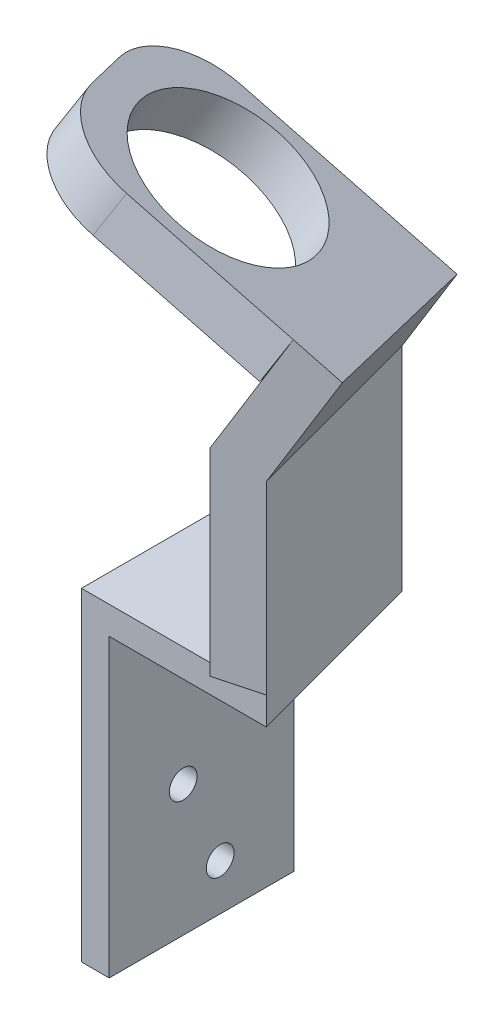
ISO-10303-21;
HEADER;
FILE_DESCRIPTION(('STEP AP214'),'2;1');
FILE_NAME('part.step','',(''),(''),'','','');
FILE_SCHEMA(('AUTOMOTIVE_DESIGN { 1 0 10303 214 1 1 1 1 }'));
ENDSEC;
DATA;
#1=APPLICATION_CONTEXT('core data for automotive mechanical design processes');
#2=APPLICATION_PROTOCOL_DEFINITION('international standard','automotive_design',2000,#1);
#3=PRODUCT_CONTEXT('',#1,'mechanical');
#4=PRODUCT('Part','Part','',(#3));
#5=PRODUCT_RELATED_PRODUCT_CATEGORY('part','',(#4));
#6=PRODUCT_DEFINITION_FORMATION('','',#4);
#7=PRODUCT_DEFINITION_CONTEXT('part definition',#1,'design');
#8=PRODUCT_DEFINITION('design','',#6,#7);
#9=PRODUCT_DEFINITION_SHAPE('','',#8);
#10=(LENGTH_UNIT() NAMED_UNIT(*) SI_UNIT(.MILLI.,.METRE.));
#11=(NAMED_UNIT(*) PLANE_ANGLE_UNIT() SI_UNIT($,.RADIAN.));
#12=(NAMED_UNIT(*) SI_UNIT($,.STERADIAN.) SOLID_ANGLE_UNIT());
#13=UNCERTAINTY_MEASURE_WITH_UNIT(LENGTH_MEASURE(1.E-05),#10,'distance_accuracy_value','');
#14=(GEOMETRIC_REPRESENTATION_CONTEXT(3) GLOBAL_UNCERTAINTY_ASSIGNED_CONTEXT((#13)) GLOBAL_UNIT_ASSIGNED_CONTEXT((#10,
#11,#12)) REPRESENTATION_CONTEXT('',''));
#15=CARTESIAN_POINT('',(0.,0.,0.));
#16=DIRECTION('',(0.,0.,1.));
#17=DIRECTION('',(1.,0.,0.));
#18=AXIS2_PLACEMENT_3D('',#15,#16,#17);
#19=CARTESIAN_POINT('',(14.8133485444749,79.150635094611,-30.9228119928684));
#20=DIRECTION('',(-0.836516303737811,0.499999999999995,0.224143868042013));
#21=DIRECTION('',(-0.5130541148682,-0.858356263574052,0.));
#22=AXIS2_PLACEMENT_3D('',#19,#20,#21);
#23=PLANE('',#22);
#24=DIRECTION('',(0.338752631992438,0.150383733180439,0.928779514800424));
#25=VECTOR('',#24,1.);
#26=CARTESIAN_POINT('',(13.0214505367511,61.6929223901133,1.3328304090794));
#27=LINE('',#26,#25);
#28=CARTESIAN_POINT('',(13.0214505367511,61.6929223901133,1.33283040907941));
#29=VERTEX_POINT('',#28);
#30=CARTESIAN_POINT('',(19.8450480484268,64.7221477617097,20.0415192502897));
#31=VERTEX_POINT('',#30);
#32=EDGE_CURVE('E199',#29,#31,#27,.T.);
#33=ORIENTED_EDGE('',*,*,#32,.F.);
#34=DIRECTION('',(-0.430682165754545,-0.852868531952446,0.295174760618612));
#35=VECTOR('',#34,1.);
#36=CARTESIAN_POINT('',(15.1748613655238,65.9572650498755,-0.143043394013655));
#37=LINE('',#36,#35);
#38=CARTESIAN_POINT('',(15.1748613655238,65.9572650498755,-0.143043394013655));
#39=VERTEX_POINT('',#38);
#40=EDGE_CURVE('E187',#39,#29,#37,.T.);
#41=ORIENTED_EDGE('',*,*,#40,.F.);
#42=DIRECTION('',(0.48296291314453,0.866025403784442,-0.129409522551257));
#43=VECTOR('',#42,1.);
#44=CARTESIAN_POINT('',(22.5325074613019,79.150635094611,-2.11451872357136));
#45=LINE('',#44,#43);
#46=CARTESIAN_POINT('',(9.81138701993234,56.3397459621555,1.29409522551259));
#47=VERTEX_POINT('',#46);
#48=EDGE_CURVE('E206',#47,#39,#45,.T.);
#49=ORIENTED_EDGE('',*,*,#48,.F.);
#50=DIRECTION('',(0.258819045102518,0.,0.965925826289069));
#51=VECTOR('',#50,1.);
#52=CARTESIAN_POINT('',(2.09222810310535,56.3397459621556,-27.5141980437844));
#53=LINE('',#52,#51);
#54=CARTESIAN_POINT('',(15.1703708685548,56.3397459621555,21.2940952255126));
#55=VERTEX_POINT('',#54);
#56=EDGE_CURVE('E181',#47,#55,#53,.T.);
#57=ORIENTED_EDGE('',*,*,#56,.T.);
#58=DIRECTION('',(-0.482962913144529,-0.866025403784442,0.129409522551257));
#59=VECTOR('',#58,1.);
#60=CARTESIAN_POINT('',(27.8914913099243,79.150635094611,17.8854812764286));
#61=LINE('',#60,#59);
#62=EDGE_CURVE('E182',#31,#55,#61,.T.);
#63=ORIENTED_EDGE('',*,*,#62,.F.);
#64=EDGE_LOOP('',(#33,#41,#49,#57,#63));
#65=FACE_BOUND('',#64,.T.);
#66=ADVANCED_FACE('F36',(#65),#23,.T.);
#67=CARTESIAN_POINT('',(0.,35.,20.));
#68=DIRECTION('',(0.,-1.,0.));
#69=DIRECTION('',(1.,0.,0.));
#70=AXIS2_PLACEMENT_3D('',#67,#68,#69);
#71=PLANE('',#70);
#72=DIRECTION('',(0.258819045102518,0.,0.965925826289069));
#73=VECTOR('',#72,1.);
#74=CARTESIAN_POINT('',(9.81138701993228,35.,1.29409522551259));
#75=LINE('',#74,#73);
#76=CARTESIAN_POINT('',(9.81138701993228,35.,1.29409522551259));
#77=VERTEX_POINT('',#76);
#78=CARTESIAN_POINT('',(14.8236190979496,35.,20.));
#79=VERTEX_POINT('',#78);
#80=EDGE_CURVE('E219',#77,#79,#75,.T.);
#81=ORIENTED_EDGE('',*,*,#80,.F.);
#82=DIRECTION('',(-0.965925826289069,0.,0.258819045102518));
#83=VECTOR('',#82,1.);
#84=CARTESIAN_POINT('',(14.6410161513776,35.,0.));
#85=LINE('',#84,#83);
#86=CARTESIAN_POINT('',(14.6410161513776,35.,0.));
#87=VERTEX_POINT('',#86);
#88=EDGE_CURVE('E222',#87,#77,#85,.T.);
#89=ORIENTED_EDGE('',*,*,#88,.F.);
#90=DIRECTION('',(-1.,0.,0.));
#91=VECTOR('',#90,1.);
#92=CARTESIAN_POINT('',(0.,35.,0.));
#93=LINE('',#92,#91);
#94=CARTESIAN_POINT('',(0.,35.,0.));
#95=VERTEX_POINT('',#94);
#96=EDGE_CURVE('E277',#87,#95,#93,.T.);
#97=ORIENTED_EDGE('',*,*,#96,.T.);
#98=DIRECTION('',(0.,0.,-1.));
#99=VECTOR('',#98,1.);
#100=CARTESIAN_POINT('',(0.,35.,20.));
#101=LINE('',#100,#99);
#102=CARTESIAN_POINT('',(0.,35.,20.));
#103=VERTEX_POINT('',#102);
#104=EDGE_CURVE('E282',#103,#95,#101,.T.);
#105=ORIENTED_EDGE('',*,*,#104,.F.);
#106=DIRECTION('',(-1.,0.,0.));
#107=VECTOR('',#106,1.);
#108=CARTESIAN_POINT('',(0.,35.,20.));
#109=LINE('',#108,#107);
#110=EDGE_CURVE('E263',#79,#103,#109,.T.);
#111=ORIENTED_EDGE('',*,*,#110,.F.);
#112=EDGE_LOOP('',(#81,#89,#97,#105,#111));
#113=FACE_BOUND('',#112,.T.);
#114=ADVANCED_FACE('F333',(#113),#71,.F.);
#115=CARTESIAN_POINT('',(3.,0.,20.));
#116=DIRECTION('',(0.,1.,0.));
#117=DIRECTION('',(0.,0.,1.));
#118=AXIS2_PLACEMENT_3D('',#115,#116,#117);
#119=PLANE('',#118);
#120=DIRECTION('',(1.,0.,0.));
#121=VECTOR('',#120,1.);
#122=CARTESIAN_POINT('',(3.,0.,0.));
#123=LINE('',#122,#121);
#124=CARTESIAN_POINT('',(0.,0.,0.));
#125=VERTEX_POINT('',#124);
#126=CARTESIAN_POINT('',(3.,0.,0.));
#127=VERTEX_POINT('',#126);
#128=EDGE_CURVE('E251',#125,#127,#123,.T.);
#129=ORIENTED_EDGE('',*,*,#128,.T.);
#130=DIRECTION('',(0.,0.,-1.));
#131=VECTOR('',#130,1.);
#132=CARTESIAN_POINT('',(3.,0.,20.));
#133=LINE('',#132,#131);
#134=CARTESIAN_POINT('',(3.,0.,20.));
#135=VERTEX_POINT('',#134);
#136=EDGE_CURVE('E288',#135,#127,#133,.T.);
#137=ORIENTED_EDGE('',*,*,#136,.F.);
#138=DIRECTION('',(1.,0.,0.));
#139=VECTOR('',#138,1.);
#140=CARTESIAN_POINT('',(3.,0.,20.));
#141=LINE('',#140,#139);
#142=CARTESIAN_POINT('',(0.,0.,20.));
#143=VERTEX_POINT('',#142);
#144=EDGE_CURVE('E252',#143,#135,#141,.T.);
#145=ORIENTED_EDGE('',*,*,#144,.F.);
#146=DIRECTION('',(0.,0.,-1.));
#147=VECTOR('',#146,1.);
#148=CARTESIAN_POINT('',(0.,0.,20.));
#149=LINE('',#148,#147);
#150=EDGE_CURVE('E269',#143,#125,#149,.T.);
#151=ORIENTED_EDGE('',*,*,#150,.T.);
#152=EDGE_LOOP('',(#129,#137,#145,#151));
#153=FACE_BOUND('',#152,.T.);
#154=ADVANCED_FACE('F338',(#153),#119,.F.);
#155=CARTESIAN_POINT('',(3.,32.,20.));
#156=DIRECTION('',(-1.,0.,0.));
#157=DIRECTION('',(0.,-1.,0.));
#158=AXIS2_PLACEMENT_3D('',#155,#156,#157);
#159=PLANE('',#158);
#160=CARTESIAN_POINT('',(3.,5.,8.));
#161=DIRECTION('',(-1.,0.,0.));
#162=DIRECTION('',(0.,-1.,0.));
#163=AXIS2_PLACEMENT_3D('',#160,#161,#162);
#164=CIRCLE('',#163,1.5);
#165=CARTESIAN_POINT('',(3.,3.5,8.));
#166=VERTEX_POINT('',#165);
#167=EDGE_CURVE('E242',#166,#166,#164,.T.);
#168=ORIENTED_EDGE('',*,*,#167,.T.);
#169=EDGE_LOOP('',(#168));
#170=FACE_BOUND('',#169,.T.);
#171=CARTESIAN_POINT('',(3.,14.1651513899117,12.));
#172=DIRECTION('',(-1.,0.,0.));
#173=DIRECTION('',(0.,-1.,0.));
#174=AXIS2_PLACEMENT_3D('',#171,#172,#173);
#175=CIRCLE('',#174,1.5);
#176=CARTESIAN_POINT('',(3.,12.6651513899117,12.));
#177=VERTEX_POINT('',#176);
#178=EDGE_CURVE('E248',#177,#177,#175,.T.);
#179=ORIENTED_EDGE('',*,*,#178,.T.);
#180=EDGE_LOOP('',(#179));
#181=FACE_BOUND('',#180,.T.);
#182=DIRECTION('',(0.,1.,0.));
#183=VECTOR('',#182,1.);
#184=CARTESIAN_POINT('',(3.,32.,0.));
#185=LINE('',#184,#183);
#186=CARTESIAN_POINT('',(3.,32.,0.));
#187=VERTEX_POINT('',#186);
#188=EDGE_CURVE('E272',#127,#187,#185,.T.);
#189=ORIENTED_EDGE('',*,*,#188,.T.);
#190=DIRECTION('',(0.,0.,-1.));
#191=VECTOR('',#190,1.);
#192=CARTESIAN_POINT('',(3.,32.,20.));
#193=LINE('',#192,#191);
#194=CARTESIAN_POINT('',(3.,32.,20.));
#195=VERTEX_POINT('',#194);
#196=EDGE_CURVE('E285',#195,#187,#193,.T.);
#197=ORIENTED_EDGE('',*,*,#196,.F.);
#198=DIRECTION('',(0.,1.,0.));
#199=VECTOR('',#198,1.);
#200=CARTESIAN_POINT('',(3.,32.,20.));
#201=LINE('',#200,#199);
#202=EDGE_CURVE('E255',#135,#195,#201,.T.);
#203=ORIENTED_EDGE('',*,*,#202,.F.);
#204=ORIENTED_EDGE('',*,*,#136,.T.);
#205=EDGE_LOOP('',(#189,#197,#203,#204));
#206=FACE_BOUND('',#205,.T.);
#207=ADVANCED_FACE('F389',(#170,#181,#206),#159,.F.);
#208=CARTESIAN_POINT('',(20.,31.9999999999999,20.));
#209=DIRECTION('',(0.,1.,0.));
#210=DIRECTION('',(-1.,0.,0.));
#211=AXIS2_PLACEMENT_3D('',#208,#209,#210);
#212=PLANE('',#211);
#213=DIRECTION('',(1.,0.,0.));
#214=VECTOR('',#213,1.);
#215=CARTESIAN_POINT('',(20.,31.9999999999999,0.));
#216=LINE('',#215,#214);
#217=CARTESIAN_POINT('',(14.6410161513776,32.,0.));
#218=VERTEX_POINT('',#217);
#219=EDGE_CURVE('E274',#187,#218,#216,.T.);
#220=ORIENTED_EDGE('',*,*,#219,.T.);
#221=DIRECTION('',(0.258819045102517,0.,0.965925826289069));
#222=VECTOR('',#221,1.);
#223=CARTESIAN_POINT('',(20.,31.9999999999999,20.));
#224=LINE('',#223,#222);
#225=CARTESIAN_POINT('',(20.,32.,20.));
#226=VERTEX_POINT('',#225);
#227=EDGE_CURVE('E171',#218,#226,#224,.T.);
#228=ORIENTED_EDGE('',*,*,#227,.T.);
#229=DIRECTION('',(1.,0.,0.));
#230=VECTOR('',#229,1.);
#231=CARTESIAN_POINT('',(20.,31.9999999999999,20.));
#232=LINE('',#231,#230);
#233=EDGE_CURVE('E258',#195,#226,#232,.T.);
#234=ORIENTED_EDGE('',*,*,#233,.F.);
#235=ORIENTED_EDGE('',*,*,#196,.T.);
#236=EDGE_LOOP('',(#220,#228,#234,#235));
#237=FACE_BOUND('',#236,.T.);
#238=ADVANCED_FACE('F384',(#237),#212,.F.);
#239=CARTESIAN_POINT('',(0.,0.,20.));
#240=DIRECTION('',(1.,0.,0.));
#241=DIRECTION('',(0.,0.,-1.));
#242=AXIS2_PLACEMENT_3D('',#239,#240,#241);
#243=PLANE('',#242);
#244=CARTESIAN_POINT('',(0.,5.,8.));
#245=DIRECTION('',(-1.,0.,0.));
#246=DIRECTION('',(0.,-1.,0.));
#247=AXIS2_PLACEMENT_3D('',#244,#245,#246);
#248=CIRCLE('',#247,1.5);
#249=CARTESIAN_POINT('',(0.,3.5,8.));
#250=VERTEX_POINT('',#249);
#251=EDGE_CURVE('E239',#250,#250,#248,.T.);
#252=ORIENTED_EDGE('',*,*,#251,.F.);
#253=EDGE_LOOP('',(#252));
#254=FACE_BOUND('',#253,.T.);
#255=CARTESIAN_POINT('',(0.,14.1651513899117,12.));
#256=DIRECTION('',(-1.,0.,0.));
#257=DIRECTION('',(0.,-1.,0.));
#258=AXIS2_PLACEMENT_3D('',#255,#256,#257);
#259=CIRCLE('',#258,1.5);
#260=CARTESIAN_POINT('',(0.,12.6651513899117,12.));
#261=VERTEX_POINT('',#260);
#262=EDGE_CURVE('E245',#261,#261,#259,.T.);
#263=ORIENTED_EDGE('',*,*,#262,.F.);
#264=EDGE_LOOP('',(#263));
#265=FACE_BOUND('',#264,.T.);
#266=DIRECTION('',(0.,-1.,0.));
#267=VECTOR('',#266,1.);
#268=CARTESIAN_POINT('',(0.,0.,0.));
#269=LINE('',#268,#267);
#270=EDGE_CURVE('E256',#95,#125,#269,.T.);
#271=ORIENTED_EDGE('',*,*,#270,.T.);
#272=ORIENTED_EDGE('',*,*,#150,.F.);
#273=DIRECTION('',(0.,-1.,0.));
#274=VECTOR('',#273,1.);
#275=CARTESIAN_POINT('',(0.,0.,20.));
#276=LINE('',#275,#274);
#277=EDGE_CURVE('E267',#103,#143,#276,.T.);
#278=ORIENTED_EDGE('',*,*,#277,.F.);
#279=ORIENTED_EDGE('',*,*,#104,.T.);
#280=EDGE_LOOP('',(#271,#272,#278,#279));
#281=FACE_BOUND('',#280,.T.);
#282=ADVANCED_FACE('F378',(#254,#265,#281),#243,.F.);
#283=CARTESIAN_POINT('',(0.,0.,20.));
#284=DIRECTION('',(0.,0.,-1.));
#285=DIRECTION('',(-1.,0.,0.));
#286=AXIS2_PLACEMENT_3D('',#283,#284,#285);
#287=PLANE('',#286);
#288=ORIENTED_EDGE('',*,*,#144,.T.);
#289=ORIENTED_EDGE('',*,*,#202,.T.);
#290=ORIENTED_EDGE('',*,*,#233,.T.);
#291=DIRECTION('',(0.,1.,0.));
#292=VECTOR('',#291,1.);
#293=CARTESIAN_POINT('',(20.,34.9999999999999,20.));
#294=LINE('',#293,#292);
#295=CARTESIAN_POINT('',(20.,34.9999999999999,20.));
#296=VERTEX_POINT('',#295);
#297=EDGE_CURVE('E261',#226,#296,#294,.T.);
#298=ORIENTED_EDGE('',*,*,#297,.T.);
#299=EDGE_CURVE('E264',#296,#79,#109,.T.);
#300=ORIENTED_EDGE('',*,*,#299,.T.);
#301=ORIENTED_EDGE('',*,*,#110,.T.);
#302=ORIENTED_EDGE('',*,*,#277,.T.);
#303=EDGE_LOOP('',(#288,#289,#290,#298,#300,#301,#302));
#304=FACE_BOUND('',#303,.T.);
#305=ADVANCED_FACE('F375',(#304),#287,.F.);
#306=CARTESIAN_POINT('',(0.,0.,0.));
#307=DIRECTION('',(0.,0.,-1.));
#308=DIRECTION('',(-1.,0.,0.));
#309=AXIS2_PLACEMENT_3D('',#306,#307,#308);
#310=PLANE('',#309);
#311=DIRECTION('',(0.,1.,0.));
#312=VECTOR('',#311,1.);
#313=CARTESIAN_POINT('',(14.6410161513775,0.,0.));
#314=LINE('',#313,#312);
#315=EDGE_CURVE('E290',#218,#87,#314,.T.);
#316=ORIENTED_EDGE('',*,*,#315,.F.);
#317=ORIENTED_EDGE('',*,*,#219,.F.);
#318=ORIENTED_EDGE('',*,*,#188,.F.);
#319=ORIENTED_EDGE('',*,*,#128,.F.);
#320=ORIENTED_EDGE('',*,*,#270,.F.);
#321=ORIENTED_EDGE('',*,*,#96,.F.);
#322=EDGE_LOOP('',(#316,#317,#318,#319,#320,#321));
#323=FACE_BOUND('',#322,.T.);
#324=ADVANCED_FACE('F373',(#323),#310,.T.);
#325=CARTESIAN_POINT('',(20.,14.1651513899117,12.));
#326=DIRECTION('',(-1.,0.,0.));
#327=DIRECTION('',(0.,-1.,0.));
#328=AXIS2_PLACEMENT_3D('',#325,#326,#327);
#329=CYLINDRICAL_SURFACE('',#328,1.5);
#330=ORIENTED_EDGE('',*,*,#262,.T.);
#331=EDGE_LOOP('',(#330));
#332=FACE_BOUND('',#331,.T.);
#333=ORIENTED_EDGE('',*,*,#178,.F.);
#334=EDGE_LOOP('',(#333));
#335=FACE_BOUND('',#334,.T.);
#336=ADVANCED_FACE('F369',(#332,#335),#329,.F.);
#337=CARTESIAN_POINT('',(20.,5.,8.));
#338=DIRECTION('',(-1.,0.,0.));
#339=DIRECTION('',(0.,-1.,0.));
#340=AXIS2_PLACEMENT_3D('',#337,#338,#339);
#341=CYLINDRICAL_SURFACE('',#340,1.5);
#342=ORIENTED_EDGE('',*,*,#251,.T.);
#343=EDGE_LOOP('',(#342));
#344=FACE_BOUND('',#343,.T.);
#345=ORIENTED_EDGE('',*,*,#167,.F.);
#346=EDGE_LOOP('',(#345));
#347=FACE_BOUND('',#346,.T.);
#348=ADVANCED_FACE('F366',(#344,#347),#341,.F.);
#349=CARTESIAN_POINT('',(15.1703708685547,55.,21.2940952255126));
#350=DIRECTION('',(-0.258819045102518,0.,-0.965925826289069));
#351=DIRECTION('',(-0.965925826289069,0.,0.258819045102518));
#352=AXIS2_PLACEMENT_3D('',#349,#350,#351);
#353=PLANE('',#352);
#354=DIRECTION('',(0.48296291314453,0.866025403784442,-0.129409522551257));
#355=VECTOR('',#354,1.);
#356=CARTESIAN_POINT('',(20.0000000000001,54.9999999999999,20.));
#357=LINE('',#356,#355);
#358=CARTESIAN_POINT('',(20.0000000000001,54.9999999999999,20.));
#359=VERTEX_POINT('',#358);
#360=CARTESIAN_POINT('',(26.4796965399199,66.6190739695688,18.2637705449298));
#361=VERTEX_POINT('',#360);
#362=EDGE_CURVE('E160',#359,#361,#357,.T.);
#363=ORIENTED_EDGE('',*,*,#362,.T.);
#364=DIRECTION('',(-0.836516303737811,0.499999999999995,0.224143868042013));
#365=VECTOR('',#364,1.);
#366=CARTESIAN_POINT('',(40.7004737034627,58.1190739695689,14.4533247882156));
#367=LINE('',#366,#365);
#368=CARTESIAN_POINT('',(22.2971150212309,69.1190739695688,19.3844898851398));
#369=VERTEX_POINT('',#368);
#370=EDGE_CURVE('E155',#361,#369,#367,.T.);
#371=ORIENTED_EDGE('',*,*,#370,.T.);
#372=EDGE_CURVE('E168',#369,#31,#61,.T.);
#373=ORIENTED_EDGE('',*,*,#372,.T.);
#374=ORIENTED_EDGE('',*,*,#62,.T.);
#375=DIRECTION('',(0.,-1.,0.));
#376=VECTOR('',#375,1.);
#377=CARTESIAN_POINT('',(15.1703708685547,55.,21.2940952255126));
#378=LINE('',#377,#376);
#379=CARTESIAN_POINT('',(15.1703708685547,35.,21.2940952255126));
#380=VERTEX_POINT('',#379);
#381=EDGE_CURVE('E218',#55,#380,#378,.T.);
#382=ORIENTED_EDGE('',*,*,#381,.T.);
#383=DIRECTION('',(0.965925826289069,0.,-0.258819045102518));
#384=VECTOR('',#383,1.);
#385=CARTESIAN_POINT('',(15.1703708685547,35.,21.2940952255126));
#386=LINE('',#385,#384);
#387=EDGE_CURVE('E214',#380,#296,#386,.T.);
#388=ORIENTED_EDGE('',*,*,#387,.T.);
#389=DIRECTION('',(0.,-1.,0.));
#390=VECTOR('',#389,1.);
#391=CARTESIAN_POINT('',(20.0000000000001,54.9999999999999,20.));
#392=LINE('',#391,#390);
#393=EDGE_CURVE('E236',#359,#296,#392,.T.);
#394=ORIENTED_EDGE('',*,*,#393,.F.);
#395=EDGE_LOOP('',(#363,#371,#373,#374,#382,#388,#394));
#396=FACE_BOUND('',#395,.T.);
#397=ADVANCED_FACE('F167',(#396),#353,.F.);
#398=CARTESIAN_POINT('',(20.0000000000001,54.9999999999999,20.));
#399=DIRECTION('',(-0.965925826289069,0.,0.258819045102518));
#400=DIRECTION('',(0.258819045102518,0.,0.965925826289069));
#401=AXIS2_PLACEMENT_3D('',#398,#399,#400);
#402=PLANE('',#401);
#403=ORIENTED_EDGE('',*,*,#393,.T.);
#404=ORIENTED_EDGE('',*,*,#297,.F.);
#405=ORIENTED_EDGE('',*,*,#227,.F.);
#406=ORIENTED_EDGE('',*,*,#315,.T.);
#407=DIRECTION('',(0.,-1.,0.));
#408=VECTOR('',#407,1.);
#409=CARTESIAN_POINT('',(14.6410161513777,55.,0.));
#410=LINE('',#409,#408);
#411=CARTESIAN_POINT('',(14.6410161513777,55.,0.));
#412=VERTEX_POINT('',#411);
#413=EDGE_CURVE('E233',#412,#87,#410,.T.);
#414=ORIENTED_EDGE('',*,*,#413,.F.);
#415=DIRECTION('',(-0.258819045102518,0.,-0.965925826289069));
#416=VECTOR('',#415,1.);
#417=CARTESIAN_POINT('',(20.0000000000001,54.9999999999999,20.));
#418=LINE('',#417,#416);
#419=EDGE_CURVE('E215',#359,#412,#418,.T.);
#420=ORIENTED_EDGE('',*,*,#419,.F.);
#421=EDGE_LOOP('',(#403,#404,#405,#406,#414,#420));
#422=FACE_BOUND('',#421,.T.);
#423=ADVANCED_FACE('F359',(#422),#402,.F.);
#424=CARTESIAN_POINT('',(14.6410161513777,55.,0.));
#425=DIRECTION('',(0.258819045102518,0.,0.965925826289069));
#426=DIRECTION('',(0.965925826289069,0.,-0.258819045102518));
#427=AXIS2_PLACEMENT_3D('',#424,#425,#426);
#428=PLANE('',#427);
#429=ORIENTED_EDGE('',*,*,#48,.T.);
#430=DIRECTION('',(-0.836516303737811,0.499999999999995,0.224143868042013));
#431=VECTOR('',#430,1.);
#432=CARTESIAN_POINT('',(33.5782200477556,54.9572650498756,-5.07420849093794));
#433=LINE('',#432,#431);
#434=CARTESIAN_POINT('',(19.3574428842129,63.4572650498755,-1.26376273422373));
#435=VERTEX_POINT('',#434);
#436=EDGE_CURVE('E172',#435,#39,#433,.T.);
#437=ORIENTED_EDGE('',*,*,#436,.F.);
#438=DIRECTION('',(-0.48296291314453,-0.866025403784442,0.129409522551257));
#439=VECTOR('',#438,1.);
#440=CARTESIAN_POINT('',(14.6410161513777,55.,0.));
#441=LINE('',#440,#439);
#442=EDGE_CURVE('E209',#435,#412,#441,.T.);
#443=ORIENTED_EDGE('',*,*,#442,.T.);
#444=ORIENTED_EDGE('',*,*,#413,.T.);
#445=ORIENTED_EDGE('',*,*,#88,.T.);
#446=DIRECTION('',(0.,-1.,0.));
#447=VECTOR('',#446,1.);
#448=CARTESIAN_POINT('',(9.81138701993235,55.,1.29409522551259));
#449=LINE('',#448,#447);
#450=EDGE_CURVE('E230',#47,#77,#449,.T.);
#451=ORIENTED_EDGE('',*,*,#450,.F.);
#452=EDGE_LOOP('',(#429,#437,#443,#444,#445,#451));
#453=FACE_BOUND('',#452,.T.);
#454=ADVANCED_FACE('F355',(#453),#428,.F.);
#455=CARTESIAN_POINT('',(9.81138701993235,55.,1.29409522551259));
#456=DIRECTION('',(0.965925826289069,0.,-0.258819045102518));
#457=DIRECTION('',(-0.258819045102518,0.,-0.965925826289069));
#458=AXIS2_PLACEMENT_3D('',#455,#456,#457);
#459=PLANE('',#458);
#460=ORIENTED_EDGE('',*,*,#80,.T.);
#461=EDGE_CURVE('E225',#79,#380,#75,.T.);
#462=ORIENTED_EDGE('',*,*,#461,.T.);
#463=ORIENTED_EDGE('',*,*,#381,.F.);
#464=ORIENTED_EDGE('',*,*,#56,.F.);
#465=ORIENTED_EDGE('',*,*,#450,.T.);
#466=EDGE_LOOP('',(#460,#462,#463,#464,#465));
#467=FACE_BOUND('',#466,.T.);
#468=ADVANCED_FACE('F351',(#467),#459,.F.);
#469=CARTESIAN_POINT('',(1.02941693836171E-13,35.,0.));
#470=DIRECTION('',(0.,1.,0.));
#471=DIRECTION('',(-1.,0.,0.));
#472=AXIS2_PLACEMENT_3D('',#469,#470,#471);
#473=PLANE('',#472);
#474=ORIENTED_EDGE('',*,*,#299,.F.);
#475=ORIENTED_EDGE('',*,*,#387,.F.);
#476=ORIENTED_EDGE('',*,*,#461,.F.);
#477=EDGE_LOOP('',(#474,#475,#476));
#478=FACE_BOUND('',#477,.T.);
#479=ADVANCED_FACE('F347',(#478),#473,.F.);
#480=CARTESIAN_POINT('',(6.92185723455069,55.,-28.808293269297));
#481=DIRECTION('',(0.836516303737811,-0.499999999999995,-0.224143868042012));
#482=DIRECTION('',(0.513054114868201,0.858356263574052,0.));
#483=AXIS2_PLACEMENT_3D('',#480,#481,#482);
#484=PLANE('',#483);
#485=DIRECTION('',(-0.338752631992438,-0.150383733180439,-0.928779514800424));
#486=VECTOR('',#485,1.);
#487=CARTESIAN_POINT('',(8.83334096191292,58.7852608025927,-30.1183585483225));
#488=LINE('',#487,#486);
#489=EDGE_CURVE('E293',#361,#435,#488,.T.);
#490=ORIENTED_EDGE('',*,*,#489,.F.);
#491=ORIENTED_EDGE('',*,*,#362,.F.);
#492=ORIENTED_EDGE('',*,*,#419,.T.);
#493=ORIENTED_EDGE('',*,*,#442,.F.);
#494=EDGE_LOOP('',(#490,#491,#492,#493));
#495=FACE_BOUND('',#494,.T.);
#496=ADVANCED_FACE('F344',(#495),#484,.T.);
#497=CARTESIAN_POINT('',(-16.9415893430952,10.1262756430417,4.53948518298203));
#498=DIRECTION('',(-0.836516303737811,0.499999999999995,0.224143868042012));
#499=DIRECTION('',(-0.513054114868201,-0.858356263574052,0.));
#500=AXIS2_PLACEMENT_3D('',#497,#498,#499);
#501=PLANE('',#500);
#502=CARTESIAN_POINT('',(20.1437041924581,64.8547313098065,20.8603636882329));
#503=VERTEX_POINT('',#502);
#504=EDGE_CURVE('E179',#31,#503,#27,.T.);
#505=ORIENTED_EDGE('',*,*,#504,.F.);
#506=ORIENTED_EDGE('',*,*,#372,.F.);
#507=DIRECTION('',(0.430682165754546,0.852868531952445,-0.295174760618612));
#508=VECTOR('',#507,1.);
#509=CARTESIAN_POINT('',(20.1437041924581,64.8547313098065,20.8603636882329));
#510=LINE('',#509,#508);
#511=EDGE_CURVE('E177',#503,#369,#510,.T.);
#512=ORIENTED_EDGE('',*,*,#511,.F.);
#513=EDGE_LOOP('',(#505,#506,#512));
#514=FACE_BOUND('',#513,.T.);
#515=ADVANCED_FACE('F176',(#514),#501,.F.);
#516=CARTESIAN_POINT('',(-0.769203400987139,77.3547313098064,26.4639603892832));
#517=DIRECTION('',(-0.338752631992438,-0.15038373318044,-0.928779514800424));
#518=DIRECTION('',(-0.939463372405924,0.,0.342649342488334));
#519=AXIS2_PLACEMENT_3D('',#516,#517,#518);
#520=PLANE('',#519);
#521=DIRECTION('',(0.836516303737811,-0.499999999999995,-0.224143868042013));
#522=VECTOR('',#521,1.);
#523=CARTESIAN_POINT('',(1.38420742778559,81.6190739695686,24.9880865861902));
#524=LINE('',#523,#522);
#525=CARTESIAN_POINT('',(8.07633785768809,77.6190739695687,23.194935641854));
#526=VERTEX_POINT('',#525);
#527=EDGE_CURVE('E152',#526,#369,#524,.T.);
#528=ORIENTED_EDGE('',*,*,#527,.F.);
#529=DIRECTION('',(0.430682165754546,0.852868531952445,-0.295174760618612));
#530=VECTOR('',#529,1.);
#531=CARTESIAN_POINT('',(5.92292702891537,73.3547313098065,24.6708094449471));
#532=LINE('',#531,#530);
#533=CARTESIAN_POINT('',(5.92292702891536,73.3547313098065,24.6708094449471));
#534=VERTEX_POINT('',#533);
#535=EDGE_CURVE('E11',#526,#534,#532,.F.);
#536=ORIENTED_EDGE('',*,*,#535,.T.);
#537=DIRECTION('',(0.836516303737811,-0.499999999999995,-0.224143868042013));
#538=VECTOR('',#537,1.);
#539=CARTESIAN_POINT('',(-0.769203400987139,77.3547313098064,26.4639603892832));
#540=LINE('',#539,#538);
#541=EDGE_CURVE('E186',#534,#503,#540,.T.);
#542=ORIENTED_EDGE('',*,*,#541,.T.);
#543=ORIENTED_EDGE('',*,*,#511,.T.);
#544=EDGE_LOOP('',(#528,#536,#542,#543));
#545=FACE_BOUND('',#544,.T.);
#546=ADVANCED_FACE('F184',(#545),#520,.F.);
#547=CARTESIAN_POINT('',(1.38420742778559,81.6190739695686,24.9880865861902));
#548=DIRECTION('',(-0.430682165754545,-0.852868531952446,0.295174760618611));
#549=DIRECTION('',(0.89264171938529,-0.450766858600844,0.));
#550=AXIS2_PLACEMENT_3D('',#547,#548,#549);
#551=PLANE('',#550);
#552=CARTESIAN_POINT('',(8.2795343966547,73.7881695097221,12.4225215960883));
#553=DIRECTION('',(0.430682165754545,0.852868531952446,-0.295174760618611));
#554=DIRECTION('',(-0.89264171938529,0.450766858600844,0.));
#555=AXIS2_PLACEMENT_3D('',#552,#553,#554);
#556=CIRCLE('',#555,8.99999999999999);
#557=CARTESIAN_POINT('',(0.245758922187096,77.8450712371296,12.4225215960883));
#558=VERTEX_POINT('',#557);
#559=EDGE_CURVE('E193',#558,#558,#556,.T.);
#560=ORIENTED_EDGE('',*,*,#559,.F.);
#561=EDGE_LOOP('',(#560));
#562=FACE_BOUND('',#561,.T.);
#563=DIRECTION('',(0.836516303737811,-0.499999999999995,-0.224143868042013));
#564=VECTOR('',#563,1.);
#565=CARTESIAN_POINT('',(-5.73804622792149,78.4572650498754,5.46055330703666));
#566=LINE('',#565,#564);
#567=CARTESIAN_POINT('',(0.954084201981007,74.4572650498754,3.66740236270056));
#568=VERTEX_POINT('',#567);
#569=EDGE_CURVE('E161',#568,#39,#566,.T.);
#570=ORIENTED_EDGE('',*,*,#569,.F.);
#571=CARTESIAN_POINT('',(3.66410525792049,75.6603349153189,11.0976384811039));
#572=DIRECTION('',(-0.430682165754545,-0.852868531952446,0.295174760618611));
#573=DIRECTION('',(0.89264171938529,-0.450766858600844,0.));
#574=AXIS2_PLACEMENT_3D('',#571,#572,#573);
#575=CIRCLE('',#574,8.);
#576=CARTESIAN_POINT('',(-3.02802517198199,79.6603349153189,12.89078942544));
#577=VERTEX_POINT('',#576);
#578=EDGE_CURVE('E44',#568,#577,#575,.F.);
#579=ORIENTED_EDGE('',*,*,#578,.T.);
#580=DIRECTION('',(-0.338752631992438,-0.150383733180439,-0.928779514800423));
#581=VECTOR('',#580,1.);
#582=CARTESIAN_POINT('',(1.38420742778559,81.6190739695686,24.9880865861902));
#583=LINE('',#582,#581);
#584=CARTESIAN_POINT('',(-1.32581362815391,80.4160041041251,17.5578504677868));
#585=VERTEX_POINT('',#584);
#586=EDGE_CURVE('E201',#585,#577,#583,.T.);
#587=ORIENTED_EDGE('',*,*,#586,.F.);
#588=CARTESIAN_POINT('',(5.36631680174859,76.4160041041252,15.7646995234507));
#589=DIRECTION('',(-0.430682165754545,-0.852868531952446,0.295174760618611));
#590=DIRECTION('',(0.89264171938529,-0.450766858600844,0.));
#591=AXIS2_PLACEMENT_3D('',#588,#589,#590);
#592=CIRCLE('',#591,8.);
#593=EDGE_CURVE('E51',#585,#526,#592,.F.);
#594=ORIENTED_EDGE('',*,*,#593,.T.);
#595=ORIENTED_EDGE('',*,*,#527,.T.);
#596=ORIENTED_EDGE('',*,*,#370,.F.);
#597=ORIENTED_EDGE('',*,*,#489,.T.);
#598=ORIENTED_EDGE('',*,*,#436,.T.);
#599=EDGE_LOOP('',(#570,#579,#587,#594,#595,#596,#597,#598));
#600=FACE_BOUND('',#599,.T.);
#601=ADVANCED_FACE('F154',(#562,#600),#551,.F.);
#602=CARTESIAN_POINT('',(-5.73804622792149,78.4572650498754,5.46055330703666));
#603=DIRECTION('',(0.338752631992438,0.15038373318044,0.928779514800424));
#604=DIRECTION('',(0.939463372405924,0.,-0.342649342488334));
#605=AXIS2_PLACEMENT_3D('',#602,#603,#604);
#606=PLANE('',#605);
#607=DIRECTION('',(0.836516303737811,-0.499999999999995,-0.224143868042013));
#608=VECTOR('',#607,1.);
#609=CARTESIAN_POINT('',(-7.89145705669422,74.1929223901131,6.93642711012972));
#610=LINE('',#609,#608);
#611=CARTESIAN_POINT('',(-1.19932662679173,70.1929223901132,5.14327616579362));
#612=VERTEX_POINT('',#611);
#613=EDGE_CURVE('E203',#612,#29,#610,.T.);
#614=ORIENTED_EDGE('',*,*,#613,.F.);
#615=DIRECTION('',(-0.430682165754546,-0.852868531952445,0.295174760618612));
#616=VECTOR('',#615,1.);
#617=CARTESIAN_POINT('',(0.954084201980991,74.4572650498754,3.66740236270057));
#618=LINE('',#617,#616);
#619=EDGE_CURVE('E59',#612,#568,#618,.F.);
#620=ORIENTED_EDGE('',*,*,#619,.T.);
#621=ORIENTED_EDGE('',*,*,#569,.T.);
#622=ORIENTED_EDGE('',*,*,#40,.T.);
#623=EDGE_LOOP('',(#614,#620,#621,#622));
#624=FACE_BOUND('',#623,.T.);
#625=ADVANCED_FACE('F319',(#624),#606,.F.);
#626=CARTESIAN_POINT('',(-7.89145705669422,74.1929223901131,6.93642711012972));
#627=DIRECTION('',(0.430682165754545,0.852868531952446,-0.295174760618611));
#628=DIRECTION('',(-0.89264171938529,0.450766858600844,0.));
#629=AXIS2_PLACEMENT_3D('',#626,#627,#628);
#630=PLANE('',#629);
#631=CARTESIAN_POINT('',(6.12612356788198,69.5238268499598,13.8983953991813));
#632=DIRECTION('',(0.430682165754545,0.852868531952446,-0.295174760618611));
#633=DIRECTION('',(-0.89264171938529,0.450766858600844,0.));
#634=AXIS2_PLACEMENT_3D('',#631,#632,#633);
#635=CIRCLE('',#634,8.99999999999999);
#636=CARTESIAN_POINT('',(-1.90765190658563,73.5807285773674,13.8983953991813));
#637=VERTEX_POINT('',#636);
#638=EDGE_CURVE('E188',#637,#637,#635,.T.);
#639=ORIENTED_EDGE('',*,*,#638,.T.);
#640=EDGE_LOOP('',(#639));
#641=FACE_BOUND('',#640,.T.);
#642=DIRECTION('',(0.338752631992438,0.150383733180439,0.928779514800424));
#643=VECTOR('',#642,1.);
#644=CARTESIAN_POINT('',(-7.89145705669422,74.1929223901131,6.93642711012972));
#645=LINE('',#644,#643);
#646=CARTESIAN_POINT('',(-5.18143600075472,75.3959922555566,14.3666632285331));
#647=VERTEX_POINT('',#646);
#648=CARTESIAN_POINT('',(-3.47922445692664,76.1516614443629,19.0337242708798));
#649=VERTEX_POINT('',#648);
#650=EDGE_CURVE('E196',#647,#649,#645,.T.);
#651=ORIENTED_EDGE('',*,*,#650,.F.);
#652=CARTESIAN_POINT('',(1.51069442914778,71.3959922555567,12.573512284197));
#653=DIRECTION('',(0.430682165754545,0.852868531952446,-0.295174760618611));
#654=DIRECTION('',(-0.89264171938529,0.450766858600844,0.));
#655=AXIS2_PLACEMENT_3D('',#652,#653,#654);
#656=CIRCLE('',#655,8.);
#657=EDGE_CURVE('E303',#647,#612,#656,.F.);
#658=ORIENTED_EDGE('',*,*,#657,.T.);
#659=ORIENTED_EDGE('',*,*,#613,.T.);
#660=ORIENTED_EDGE('',*,*,#32,.T.);
#661=ORIENTED_EDGE('',*,*,#504,.T.);
#662=ORIENTED_EDGE('',*,*,#541,.F.);
#663=CARTESIAN_POINT('',(3.21290597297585,72.1516614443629,17.2405733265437));
#664=DIRECTION('',(0.430682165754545,0.852868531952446,-0.295174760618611));
#665=DIRECTION('',(-0.89264171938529,0.450766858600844,0.));
#666=AXIS2_PLACEMENT_3D('',#663,#664,#665);
#667=CIRCLE('',#666,8.);
#668=EDGE_CURVE('E301',#534,#649,#667,.F.);
#669=ORIENTED_EDGE('',*,*,#668,.T.);
#670=EDGE_LOOP('',(#651,#658,#659,#660,#661,#662,#669));
#671=FACE_BOUND('',#670,.T.);
#672=ADVANCED_FACE('F318',(#641,#671),#630,.F.);
#673=CARTESIAN_POINT('',(-37.8544969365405,22.6262756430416,10.1430818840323));
#674=DIRECTION('',(-0.836516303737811,0.499999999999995,0.224143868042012));
#675=DIRECTION('',(-0.513054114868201,-0.858356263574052,0.));
#676=AXIS2_PLACEMENT_3D('',#673,#674,#675);
#677=PLANE('',#676);
#678=ORIENTED_EDGE('',*,*,#586,.T.);
#679=DIRECTION('',(-0.430682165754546,-0.852868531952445,0.295174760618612));
#680=VECTOR('',#679,1.);
#681=CARTESIAN_POINT('',(-5.18143600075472,75.3959922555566,14.3666632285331));
#682=LINE('',#681,#680);
#683=EDGE_CURVE('E298',#577,#647,#682,.T.);
#684=ORIENTED_EDGE('',*,*,#683,.T.);
#685=ORIENTED_EDGE('',*,*,#650,.T.);
#686=DIRECTION('',(0.430682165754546,0.852868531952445,-0.295174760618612));
#687=VECTOR('',#686,1.);
#688=CARTESIAN_POINT('',(-1.32581362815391,80.4160041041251,17.5578504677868));
#689=LINE('',#688,#687);
#690=EDGE_CURVE('E295',#649,#585,#689,.T.);
#691=ORIENTED_EDGE('',*,*,#690,.T.);
#692=EDGE_LOOP('',(#678,#684,#685,#691));
#693=FACE_BOUND('',#692,.T.);
#694=ADVANCED_FACE('F312',(#693),#677,.T.);
#695=CARTESIAN_POINT('',(-1.1954732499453,55.0250618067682,18.9163663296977));
#696=DIRECTION('',(0.430682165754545,0.852868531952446,-0.295174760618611));
#697=DIRECTION('',(-0.89264171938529,0.450766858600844,0.));
#698=AXIS2_PLACEMENT_3D('',#695,#696,#697);
#699=CYLINDRICAL_SURFACE('',#698,8.99999999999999);
#700=ORIENTED_EDGE('',*,*,#559,.T.);
#701=EDGE_LOOP('',(#700));
#702=FACE_BOUND('',#701,.T.);
#703=ORIENTED_EDGE('',*,*,#638,.F.);
#704=EDGE_LOOP('',(#703));
#705=FACE_BOUND('',#704,.T.);
#706=ADVANCED_FACE('F331',(#702,#705),#699,.F.);
#707=CARTESIAN_POINT('',(-23.3959311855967,22.0740585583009,29.6436578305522));
#708=DIRECTION('',(0.430682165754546,0.852868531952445,-0.295174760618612));
#709=DIRECTION('',(-0.89264171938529,0.450766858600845,0.));
#710=AXIS2_PLACEMENT_3D('',#707,#708,#709);
#711=CYLINDRICAL_SURFACE('',#710,8.);
#712=ORIENTED_EDGE('',*,*,#578,.F.);
#713=ORIENTED_EDGE('',*,*,#619,.F.);
#714=ORIENTED_EDGE('',*,*,#657,.F.);
#715=ORIENTED_EDGE('',*,*,#683,.F.);
#716=EDGE_LOOP('',(#712,#713,#714,#715));
#717=FACE_BOUND('',#716,.T.);
#718=ADVANCED_FACE('F316',(#717),#711,.T.);
#719=CARTESIAN_POINT('',(-21.6937196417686,22.8297277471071,34.3107188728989));
#720=DIRECTION('',(-0.430682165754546,-0.852868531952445,0.295174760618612));
#721=DIRECTION('',(0.89264171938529,-0.450766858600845,0.));
#722=AXIS2_PLACEMENT_3D('',#719,#720,#721);
#723=CYLINDRICAL_SURFACE('',#722,8.);
#724=ORIENTED_EDGE('',*,*,#668,.F.);
#725=ORIENTED_EDGE('',*,*,#535,.F.);
#726=ORIENTED_EDGE('',*,*,#593,.F.);
#727=ORIENTED_EDGE('',*,*,#690,.F.);
#728=EDGE_LOOP('',(#724,#725,#726,#727));
#729=FACE_BOUND('',#728,.T.);
#730=ADVANCED_FACE('F38',(#729),#723,.T.);
#731=CLOSED_SHELL('',(#66,#114,#154,#207,#238,#282,#305,#324,#336,#348,#397,#423,#454,#468,#479,
#496,#515,#546,#601,#625,#672,#694,#706,#718,#730));
#732=MANIFOLD_SOLID_BREP('B2',#731);
#733=ADVANCED_BREP_SHAPE_REPRESENTATION('',(#18,#732),#14);
#734=SHAPE_DEFINITION_REPRESENTATION(#9,#733);
ENDSEC;
END-ISO-10303-21;
